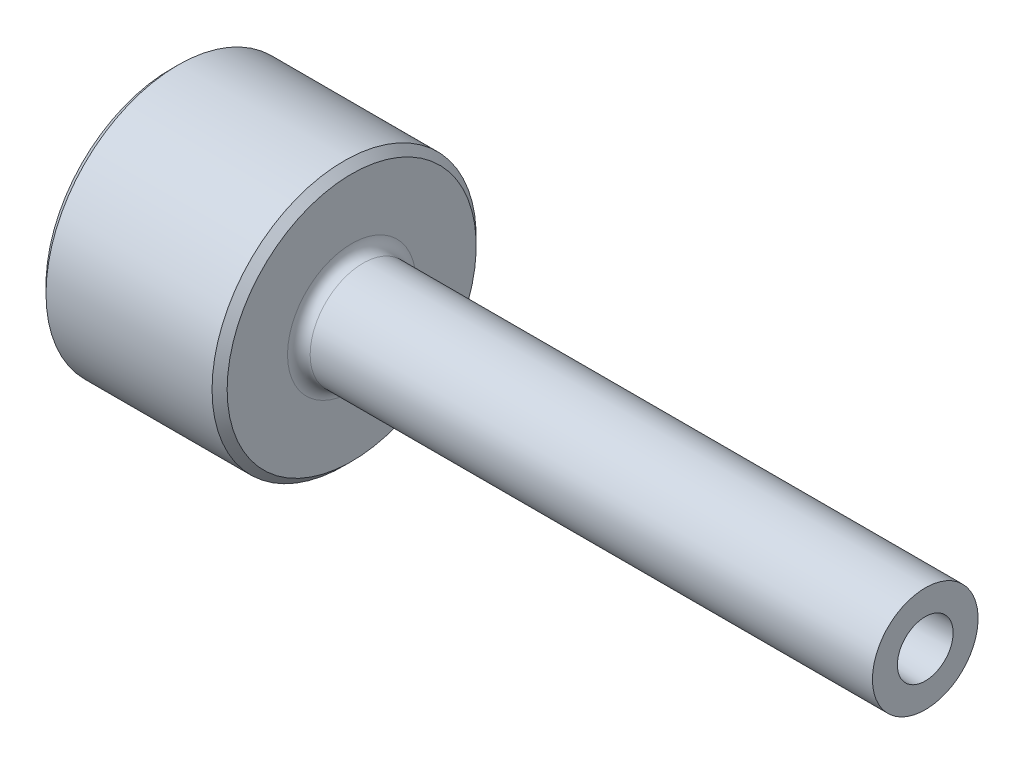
ISO-10303-21;
HEADER;
FILE_DESCRIPTION(('STEP AP214'),'2;1');
FILE_NAME('part.step','',(''),(''),'','','');
FILE_SCHEMA(('AUTOMOTIVE_DESIGN { 1 0 10303 214 1 1 1 1 }'));
ENDSEC;
DATA;
#1=APPLICATION_CONTEXT('core data for automotive mechanical design processes');
#2=APPLICATION_PROTOCOL_DEFINITION('international standard','automotive_design',2000,#1);
#3=PRODUCT_CONTEXT('',#1,'mechanical');
#4=PRODUCT('Part','Part','',(#3));
#5=PRODUCT_RELATED_PRODUCT_CATEGORY('part','',(#4));
#6=PRODUCT_DEFINITION_FORMATION('','',#4);
#7=PRODUCT_DEFINITION_CONTEXT('part definition',#1,'design');
#8=PRODUCT_DEFINITION('design','',#6,#7);
#9=PRODUCT_DEFINITION_SHAPE('','',#8);
#10=(LENGTH_UNIT() NAMED_UNIT(*) SI_UNIT(.MILLI.,.METRE.));
#11=(NAMED_UNIT(*) PLANE_ANGLE_UNIT() SI_UNIT($,.RADIAN.));
#12=(NAMED_UNIT(*) SI_UNIT($,.STERADIAN.) SOLID_ANGLE_UNIT());
#13=UNCERTAINTY_MEASURE_WITH_UNIT(LENGTH_MEASURE(1.E-05),#10,'distance_accuracy_value','');
#14=(GEOMETRIC_REPRESENTATION_CONTEXT(3) GLOBAL_UNCERTAINTY_ASSIGNED_CONTEXT((#13)) GLOBAL_UNIT_ASSIGNED_CONTEXT((#10,
#11,#12)) REPRESENTATION_CONTEXT('',''));
#15=CARTESIAN_POINT('',(0.,0.,0.));
#16=DIRECTION('',(0.,0.,1.));
#17=DIRECTION('',(1.,0.,0.));
#18=AXIS2_PLACEMENT_3D('',#15,#16,#17);
#19=CARTESIAN_POINT('',(0.,0.,0.));
#20=DIRECTION('',(-1.,0.,0.));
#21=DIRECTION('',(0.,0.,1.));
#22=AXIS2_PLACEMENT_3D('',#19,#20,#21);
#23=CYLINDRICAL_SURFACE('',#22,17.5);
#24=CARTESIAN_POINT('',(1.00000000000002,0.,0.));
#25=DIRECTION('',(1.,0.,0.));
#26=DIRECTION('',(0.,0.,-1.));
#27=AXIS2_PLACEMENT_3D('',#24,#25,#26);
#28=CIRCLE('',#27,17.5);
#29=CARTESIAN_POINT('',(1.00000000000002,0.,-17.5));
#30=VERTEX_POINT('',#29);
#31=EDGE_CURVE('E9',#30,#30,#28,.T.);
#32=ORIENTED_EDGE('',*,*,#31,.T.);
#33=EDGE_LOOP('',(#32));
#34=FACE_BOUND('',#33,.T.);
#35=CARTESIAN_POINT('',(23.,0.,0.));
#36=DIRECTION('',(-1.,0.,0.));
#37=DIRECTION('',(0.,0.,1.));
#38=AXIS2_PLACEMENT_3D('',#35,#36,#37);
#39=CIRCLE('',#38,17.5);
#40=CARTESIAN_POINT('',(23.,0.,17.5));
#41=VERTEX_POINT('',#40);
#42=EDGE_CURVE('E29',#41,#41,#39,.T.);
#43=ORIENTED_EDGE('',*,*,#42,.T.);
#44=EDGE_LOOP('',(#43));
#45=FACE_BOUND('',#44,.T.);
#46=ADVANCED_FACE('F14',(#34,#45),#23,.T.);
#47=CARTESIAN_POINT('',(24.,17.5,0.));
#48=DIRECTION('',(-1.,0.,0.));
#49=DIRECTION('',(0.,0.,1.));
#50=AXIS2_PLACEMENT_3D('',#47,#48,#49);
#51=PLANE('',#50);
#52=CARTESIAN_POINT('',(24.,0.,0.));
#53=DIRECTION('',(-1.,0.,0.));
#54=DIRECTION('',(0.,0.,1.));
#55=AXIS2_PLACEMENT_3D('',#52,#53,#54);
#56=CIRCLE('',#55,16.5);
#57=CARTESIAN_POINT('',(24.,0.,16.5));
#58=VERTEX_POINT('',#57);
#59=EDGE_CURVE('E25',#58,#58,#56,.F.);
#60=ORIENTED_EDGE('',*,*,#59,.T.);
#61=EDGE_LOOP('',(#60));
#62=FACE_BOUND('',#61,.T.);
#63=CARTESIAN_POINT('',(24.,0.,0.));
#64=DIRECTION('',(-1.,0.,0.));
#65=DIRECTION('',(0.,0.,1.));
#66=AXIS2_PLACEMENT_3D('',#63,#64,#65);
#67=CIRCLE('',#66,8.5);
#68=CARTESIAN_POINT('',(24.,0.,8.5));
#69=VERTEX_POINT('',#68);
#70=EDGE_CURVE('E34',#69,#69,#67,.T.);
#71=ORIENTED_EDGE('',*,*,#70,.T.);
#72=EDGE_LOOP('',(#71));
#73=FACE_BOUND('',#72,.T.);
#74=ADVANCED_FACE('F70',(#62,#73),#51,.F.);
#75=CARTESIAN_POINT('',(25.5,0.,0.));
#76=DIRECTION('',(-1.,0.,0.));
#77=DIRECTION('',(0.,0.,1.));
#78=AXIS2_PLACEMENT_3D('',#75,#76,#77);
#79=TOROIDAL_SURFACE('',#78,8.5,1.5);
#80=ORIENTED_EDGE('',*,*,#70,.F.);
#81=EDGE_LOOP('',(#80));
#82=FACE_BOUND('',#81,.T.);
#83=CARTESIAN_POINT('',(25.5,0.,0.));
#84=DIRECTION('',(-1.,0.,0.));
#85=DIRECTION('',(0.,0.,1.));
#86=AXIS2_PLACEMENT_3D('',#83,#84,#85);
#87=CIRCLE('',#86,7.);
#88=CARTESIAN_POINT('',(25.5,0.,7.));
#89=VERTEX_POINT('',#88);
#90=EDGE_CURVE('E37',#89,#89,#87,.T.);
#91=ORIENTED_EDGE('',*,*,#90,.T.);
#92=EDGE_LOOP('',(#91));
#93=FACE_BOUND('',#92,.T.);
#94=ADVANCED_FACE('F76',(#82,#93),#79,.F.);
#95=CARTESIAN_POINT('',(0.,0.,0.));
#96=DIRECTION('',(-1.,0.,0.));
#97=DIRECTION('',(0.,0.,1.));
#98=AXIS2_PLACEMENT_3D('',#95,#96,#97);
#99=CYLINDRICAL_SURFACE('',#98,7.);
#100=ORIENTED_EDGE('',*,*,#90,.F.);
#101=EDGE_LOOP('',(#100));
#102=FACE_BOUND('',#101,.T.);
#103=CARTESIAN_POINT('',(100.,0.,0.));
#104=DIRECTION('',(-1.,0.,0.));
#105=DIRECTION('',(0.,0.,1.));
#106=AXIS2_PLACEMENT_3D('',#103,#104,#105);
#107=CIRCLE('',#106,7.);
#108=CARTESIAN_POINT('',(100.,0.,7.));
#109=VERTEX_POINT('',#108);
#110=EDGE_CURVE('E40',#109,#109,#107,.T.);
#111=ORIENTED_EDGE('',*,*,#110,.T.);
#112=EDGE_LOOP('',(#111));
#113=FACE_BOUND('',#112,.T.);
#114=ADVANCED_FACE('F83',(#102,#113),#99,.T.);
#115=CARTESIAN_POINT('',(100.,3.69314129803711,0.));
#116=DIRECTION('',(-1.,0.,0.));
#117=DIRECTION('',(0.,0.,1.));
#118=AXIS2_PLACEMENT_3D('',#115,#116,#117);
#119=PLANE('',#118);
#120=ORIENTED_EDGE('',*,*,#110,.F.);
#121=EDGE_LOOP('',(#120));
#122=FACE_BOUND('',#121,.T.);
#123=CARTESIAN_POINT('',(100.,0.,0.));
#124=DIRECTION('',(-1.,0.,0.));
#125=DIRECTION('',(0.,0.,1.));
#126=AXIS2_PLACEMENT_3D('',#123,#124,#125);
#127=CIRCLE('',#126,3.69314129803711);
#128=CARTESIAN_POINT('',(100.,0.,3.69314129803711));
#129=VERTEX_POINT('',#128);
#130=EDGE_CURVE('E43',#129,#129,#127,.T.);
#131=ORIENTED_EDGE('',*,*,#130,.T.);
#132=EDGE_LOOP('',(#131));
#133=FACE_BOUND('',#132,.T.);
#134=ADVANCED_FACE('F87',(#122,#133),#119,.F.);
#135=CARTESIAN_POINT('',(3.,0.,0.));
#136=DIRECTION('',(1.,0.,0.));
#137=DIRECTION('',(0.,0.,-1.));
#138=AXIS2_PLACEMENT_3D('',#135,#136,#137);
#139=CONICAL_SURFACE('',#138,2.,0.0174532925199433);
#140=ORIENTED_EDGE('',*,*,#130,.F.);
#141=EDGE_LOOP('',(#140));
#142=FACE_BOUND('',#141,.T.);
#143=CARTESIAN_POINT('',(3.,0.,0.));
#144=DIRECTION('',(-1.,0.,0.));
#145=DIRECTION('',(0.,0.,1.));
#146=AXIS2_PLACEMENT_3D('',#143,#144,#145);
#147=CIRCLE('',#146,2.);
#148=CARTESIAN_POINT('',(3.,0.,2.));
#149=VERTEX_POINT('',#148);
#150=EDGE_CURVE('E46',#149,#149,#147,.T.);
#151=ORIENTED_EDGE('',*,*,#150,.T.);
#152=EDGE_LOOP('',(#151));
#153=FACE_BOUND('',#152,.T.);
#154=ADVANCED_FACE('F66',(#142,#153),#139,.F.);
#155=CARTESIAN_POINT('',(-11.7373835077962,0.,0.));
#156=DIRECTION('',(-1.,0.,0.));
#157=DIRECTION('',(0.,0.,1.));
#158=AXIS2_PLACEMENT_3D('',#155,#156,#157);
#159=DEGENERATE_TOROIDAL_SURFACE('',#158,0.794553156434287,15.,.F.);
#160=ORIENTED_EDGE('',*,*,#150,.F.);
#161=EDGE_LOOP('',(#160));
#162=FACE_BOUND('',#161,.T.);
#163=CARTESIAN_POINT('',(0.,0.,0.));
#164=DIRECTION('',(-1.,0.,0.));
#165=DIRECTION('',(0.,0.,1.));
#166=AXIS2_PLACEMENT_3D('',#163,#164,#165);
#167=CIRCLE('',#166,8.54535200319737);
#168=CARTESIAN_POINT('',(0.,0.,8.54535200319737));
#169=VERTEX_POINT('',#168);
#170=EDGE_CURVE('E49',#169,#169,#167,.T.);
#171=ORIENTED_EDGE('',*,*,#170,.T.);
#172=EDGE_LOOP('',(#171));
#173=FACE_BOUND('',#172,.T.);
#174=ADVANCED_FACE('F53',(#162,#173),#159,.T.);
#175=CARTESIAN_POINT('',(0.,8.54535200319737,0.));
#176=DIRECTION('',(1.,0.,0.));
#177=DIRECTION('',(0.,0.,-1.));
#178=AXIS2_PLACEMENT_3D('',#175,#176,#177);
#179=PLANE('',#178);
#180=CARTESIAN_POINT('',(0.,0.,0.));
#181=DIRECTION('',(1.,0.,0.));
#182=DIRECTION('',(0.,0.,-1.));
#183=AXIS2_PLACEMENT_3D('',#180,#181,#182);
#184=CIRCLE('',#183,16.5);
#185=CARTESIAN_POINT('',(0.,0.,-16.5));
#186=VERTEX_POINT('',#185);
#187=EDGE_CURVE('E21',#186,#186,#184,.F.);
#188=ORIENTED_EDGE('',*,*,#187,.T.);
#189=EDGE_LOOP('',(#188));
#190=FACE_BOUND('',#189,.T.);
#191=ORIENTED_EDGE('',*,*,#170,.F.);
#192=EDGE_LOOP('',(#191));
#193=FACE_BOUND('',#192,.T.);
#194=ADVANCED_FACE('F55',(#190,#193),#179,.F.);
#195=CARTESIAN_POINT('',(23.,0.,0.));
#196=DIRECTION('',(-1.,0.,0.));
#197=DIRECTION('',(0.,0.,1.));
#198=AXIS2_PLACEMENT_3D('',#195,#196,#197);
#199=CONICAL_SURFACE('',#198,17.5,0.785398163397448);
#200=ORIENTED_EDGE('',*,*,#59,.F.);
#201=EDGE_LOOP('',(#200));
#202=FACE_BOUND('',#201,.T.);
#203=ORIENTED_EDGE('',*,*,#42,.F.);
#204=EDGE_LOOP('',(#203));
#205=FACE_BOUND('',#204,.T.);
#206=ADVANCED_FACE('F57',(#202,#205),#199,.T.);
#207=CARTESIAN_POINT('',(0.,0.,0.));
#208=DIRECTION('',(1.,0.,0.));
#209=DIRECTION('',(0.,0.,-1.));
#210=AXIS2_PLACEMENT_3D('',#207,#208,#209);
#211=CONICAL_SURFACE('',#210,16.5,0.785398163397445);
#212=ORIENTED_EDGE('',*,*,#31,.F.);
#213=EDGE_LOOP('',(#212));
#214=FACE_BOUND('',#213,.T.);
#215=ORIENTED_EDGE('',*,*,#187,.F.);
#216=EDGE_LOOP('',(#215));
#217=FACE_BOUND('',#216,.T.);
#218=ADVANCED_FACE('F16',(#214,#217),#211,.T.);
#219=CLOSED_SHELL('',(#46,#74,#94,#114,#134,#154,#174,#194,#206,#218));
#220=MANIFOLD_SOLID_BREP('B1',#219);
#221=ADVANCED_BREP_SHAPE_REPRESENTATION('',(#18,#220),#14);
#222=SHAPE_DEFINITION_REPRESENTATION(#9,#221);
ENDSEC;
END-ISO-10303-21;
